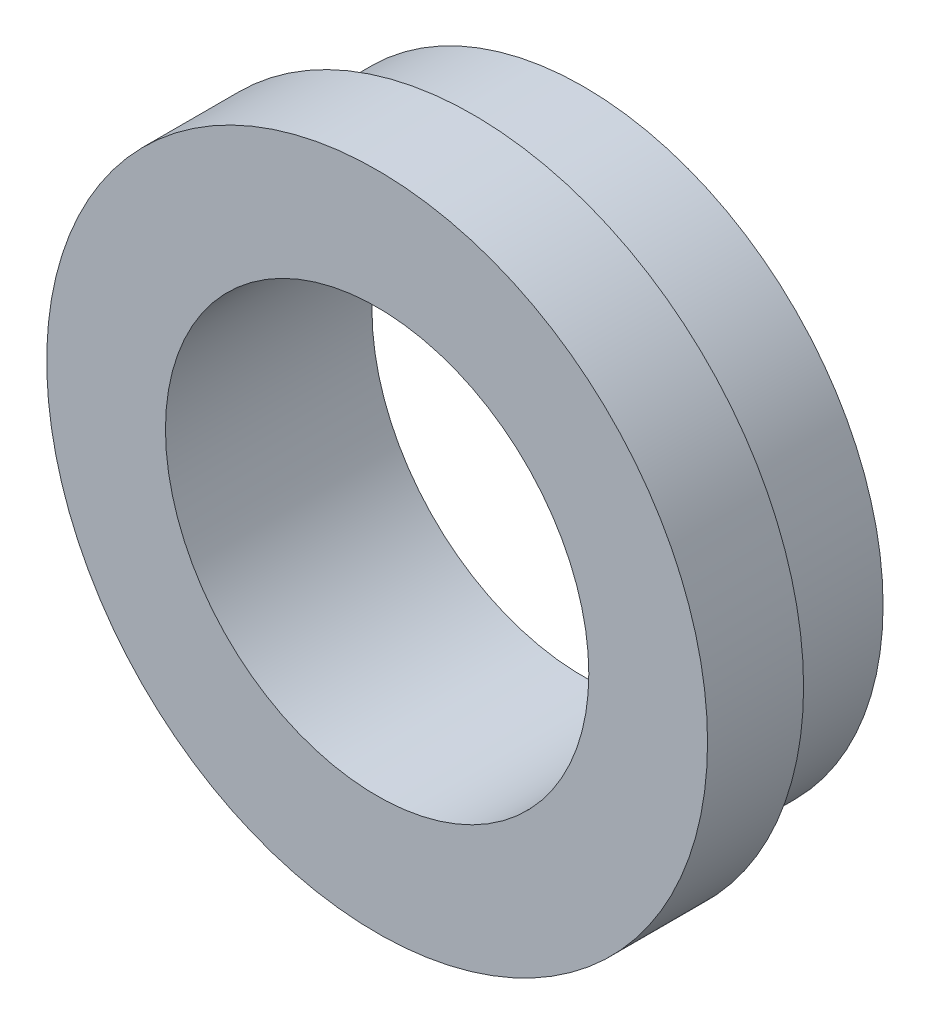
from build123d import *

# Parameters (mm, degrees)
ESQUISSE5_R             = 16
BOSS_EXTRU_8_DEPTH      = 4.65
ESQUISSE13_R            = 14.5
BOSS_EXTRU_9_DEPTH      = 5.35
ESQUISSE14_R            = 10.25
ENL_V_MAT_EXTRU_8_DEPTH = 25.738633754


with BuildPart() as part:
    # Esquisse5 → Boss.-Extru.8 (new body)
    with BuildSketch(Plane.XY.offset(-12.65)):
        Circle(ESQUISSE5_R)
    extrude(amount=BOSS_EXTRU_8_DEPTH)

    # Esquisse13 → Boss.-Extru.9 (add)
    with BuildSketch(Plane(origin=(0, 0, -12.65), x_dir=(-1, 0, 0), z_dir=(0, 0, -1))):
        with Locations(Location((0, 0, 0), (0, 0, 180))):
            Circle(ESQUISSE13_R)
    extrude(amount=BOSS_EXTRU_9_DEPTH)

    # Esquisse14 → Enl_v. mat.-Extru.8 (cut, through all)
    with BuildSketch(Plane(origin=(0, 0, -18), x_dir=(-1, 0, 0), z_dir=(0, 0, -1))):
        Circle(ESQUISSE14_R)
    extrude(amount=-ENL_V_MAT_EXTRU_8_DEPTH, mode=Mode.SUBTRACT)


solid = part.part
